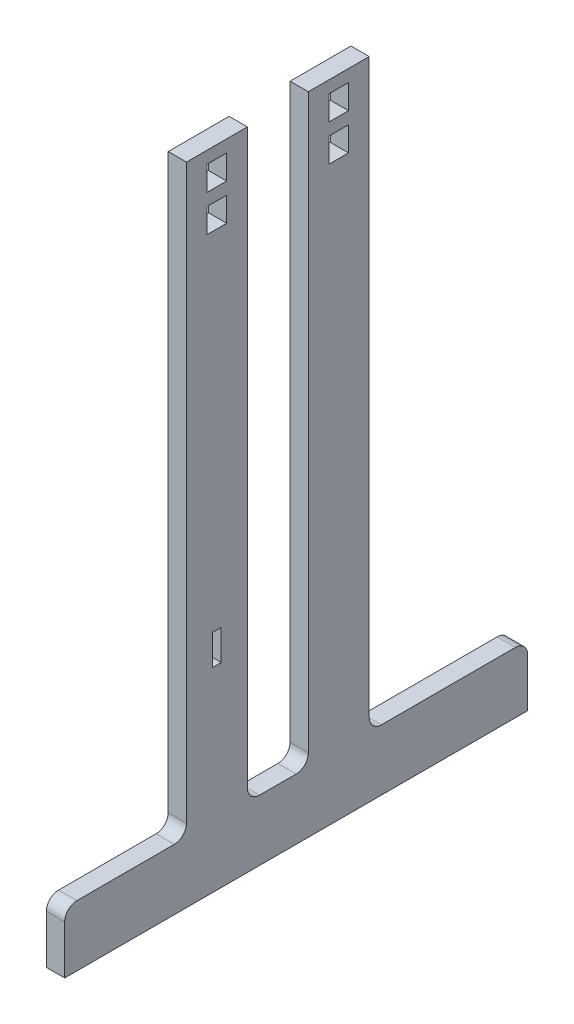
from build123d import *

# Parameters (mm, degrees)
SALIENTE_EXTRUIR1_DEPTH = 15
REDONDEO1_R             = 10
REDONDEO2_R             = 10
REDONDEO3_R             = 10
CROQUIS3_W              = 16
CROQUIS3_H              = 20
CORTAR_EXTRUIR1_DEPTH   = 653.322772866
CROQUIS4_W              = 7
CROQUIS4_H              = 25
CORTAR_EXTRUIR2_DEPTH   = 653.322772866


with BuildPart() as part:
    # Croquis1 → Saliente-Extruir1 (new body)
    with BuildSketch(Plane(origin=(0, 0, 0), x_dir=(0, 0, -1), z_dir=(1, 0, 0))):
        Polygon((0, 0), (380, 0), (380, 50), (250, 50), (250, 530), (200, 530), (200, 50), (150, 50), (150, 530), (100, 530), (100, 50), (0, 50), align=None)
    extrude(amount=SALIENTE_EXTRUIR1_DEPTH)

    # Redondeo1
    redondeo1_edges = [part.edges().sort_by_distance(p)[0] for p in [
        (7.5, 50, -100),
        (7.5, 50, -150),
        (7.5, 50, -200),
        (7.5, 50, -250),
    ]]
    fillet(redondeo1_edges, radius=REDONDEO1_R)

    # Redondeo2
    redondeo2_edges = [part.edges().sort_by_distance(p)[0] for p in [
        (7.5, 50, 0),
    ]]
    fillet(redondeo2_edges, radius=REDONDEO2_R)

    # Redondeo3
    redondeo3_edges = [part.edges().sort_by_distance(p)[0] for p in [
        (7.5, 50, -380),
    ]]
    fillet(redondeo3_edges, radius=REDONDEO3_R)

    # Croquis3 → Cortar-Extruir1 (cut, through all)
    with BuildSketch(Plane(origin=(0, 0, 0), x_dir=(0, 0, -1), z_dir=(1, 0, 0))):
        with Locations((125, 510)):
            Rectangle(CROQUIS3_W, CROQUIS3_H)
        with Locations((225, 510)):
            Rectangle(CROQUIS3_W, CROQUIS3_H)
        with Locations((125, 480)):
            Rectangle(CROQUIS3_W, CROQUIS3_H)
        with Locations((225, 480)):
            Rectangle(CROQUIS3_W, CROQUIS3_H)
    extrude(amount=CORTAR_EXTRUIR1_DEPTH, mode=Mode.SUBTRACT)

    # Croquis4 → Cortar-Extruir2 (cut, through all)
    with BuildSketch(Plane(origin=(0, 0, 0), x_dir=(0, 0, -1), z_dir=(1, 0, 0))):
        with Locations((125, 172.5)):
            Rectangle(CROQUIS4_W, CROQUIS4_H)
    extrude(amount=CORTAR_EXTRUIR2_DEPTH, mode=Mode.SUBTRACT)


solid = part.part
